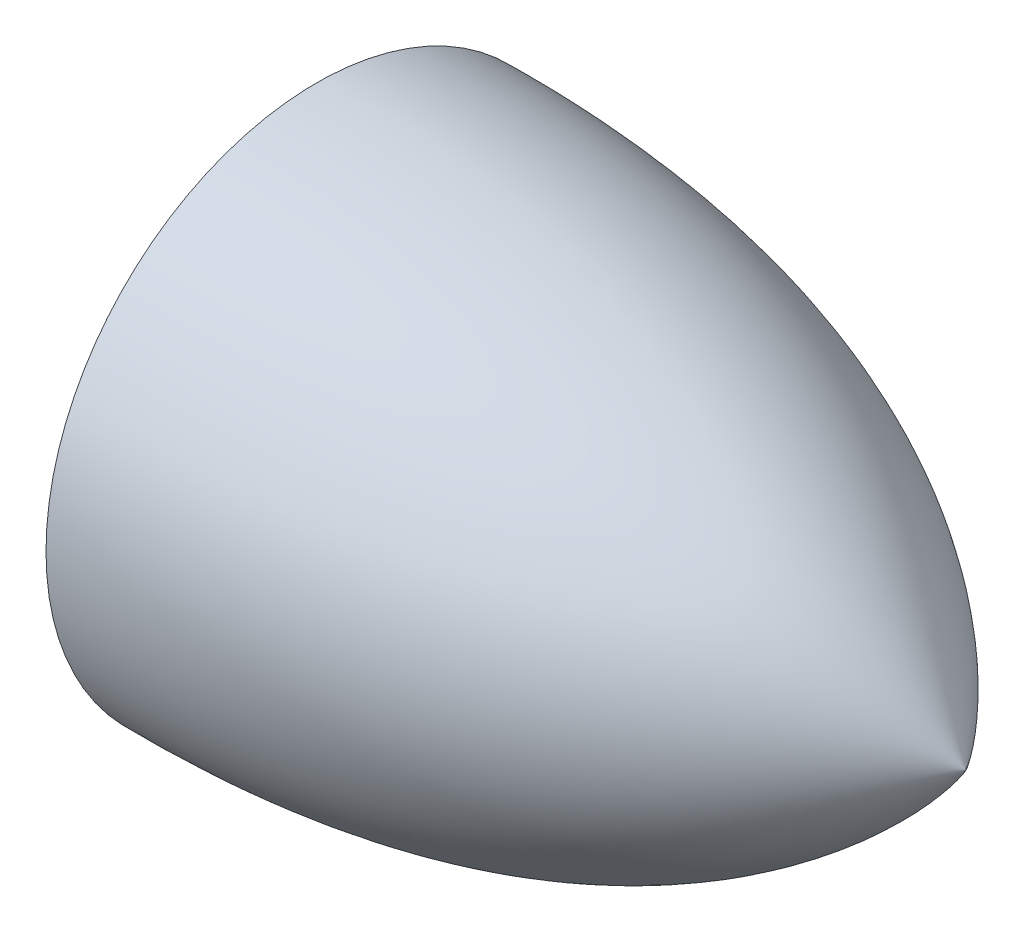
ISO-10303-21;
HEADER;
FILE_DESCRIPTION(('STEP AP214'),'2;1');
FILE_NAME('part.step','',(''),(''),'','','');
FILE_SCHEMA(('AUTOMOTIVE_DESIGN { 1 0 10303 214 1 1 1 1 }'));
ENDSEC;
DATA;
#1=APPLICATION_CONTEXT('core data for automotive mechanical design processes');
#2=APPLICATION_PROTOCOL_DEFINITION('international standard','automotive_design',2000,#1);
#3=PRODUCT_CONTEXT('',#1,'mechanical');
#4=PRODUCT('Part','Part','',(#3));
#5=PRODUCT_RELATED_PRODUCT_CATEGORY('part','',(#4));
#6=PRODUCT_DEFINITION_FORMATION('','',#4);
#7=PRODUCT_DEFINITION_CONTEXT('part definition',#1,'design');
#8=PRODUCT_DEFINITION('design','',#6,#7);
#9=PRODUCT_DEFINITION_SHAPE('','',#8);
#10=(LENGTH_UNIT() NAMED_UNIT(*) SI_UNIT(.MILLI.,.METRE.));
#11=(NAMED_UNIT(*) PLANE_ANGLE_UNIT() SI_UNIT($,.RADIAN.));
#12=(NAMED_UNIT(*) SI_UNIT($,.STERADIAN.) SOLID_ANGLE_UNIT());
#13=UNCERTAINTY_MEASURE_WITH_UNIT(LENGTH_MEASURE(1.E-05),#10,'distance_accuracy_value','');
#14=(GEOMETRIC_REPRESENTATION_CONTEXT(3) GLOBAL_UNCERTAINTY_ASSIGNED_CONTEXT((#13)) GLOBAL_UNIT_ASSIGNED_CONTEXT((#10,
#11,#12)) REPRESENTATION_CONTEXT('',''));
#15=CARTESIAN_POINT('',(0.,0.,0.));
#16=DIRECTION('',(0.,0.,1.));
#17=DIRECTION('',(1.,0.,0.));
#18=AXIS2_PLACEMENT_3D('',#15,#16,#17);
#19=CARTESIAN_POINT('',(6.,0.,0.));
#20=CARTESIAN_POINT('',(4.20094512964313,0.,-2.54796013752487));
#21=CARTESIAN_POINT('',(0.,0.,-2.5));
#22=B_SPLINE_CURVE_WITH_KNOTS('',2,(#19,#20,#21),.UNSPECIFIED.,.F.,.F.,(3,3),(0.,
0.789485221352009),.UNSPECIFIED.);
#23=CARTESIAN_POINT('',(-6.1095422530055,0.,0.));
#24=DIRECTION('',(-1.,0.,0.));
#25=AXIS1_PLACEMENT('',#23,#24);
#26=SURFACE_OF_REVOLUTION('',#22,#25);
#27=CARTESIAN_POINT('',(0.,0.,0.));
#28=DIRECTION('',(-1.,0.,0.));
#29=DIRECTION('',(0.,0.,1.));
#30=AXIS2_PLACEMENT_3D('',#27,#28,#29);
#31=CIRCLE('',#30,2.5);
#32=CARTESIAN_POINT('',(0.,0.,2.5));
#33=VERTEX_POINT('',#32);
#34=EDGE_CURVE('E11',#33,#33,#31,.T.);
#35=ORIENTED_EDGE('',*,*,#34,.F.);
#36=EDGE_LOOP('',(#35));
#37=FACE_BOUND('',#36,.T.);
#38=CARTESIAN_POINT('',(6.,0.,0.));
#39=VERTEX_POINT('',#38);
#40=VERTEX_LOOP('',#39);
#41=FACE_BOUND('',#40,.T.);
#42=ADVANCED_FACE('F32',(#37,#41),#26,.T.);
#43=CARTESIAN_POINT('',(0.,0.,-2.5));
#44=DIRECTION('',(1.,0.,0.));
#45=DIRECTION('',(0.,0.,-1.));
#46=AXIS2_PLACEMENT_3D('',#43,#44,#45);
#47=PLANE('',#46);
#48=CARTESIAN_POINT('',(0.,0.,0.));
#49=DIRECTION('',(-1.,0.,0.));
#50=DIRECTION('',(0.,0.,1.));
#51=AXIS2_PLACEMENT_3D('',#48,#49,#50);
#52=CIRCLE('',#51,0.75);
#53=CARTESIAN_POINT('',(0.,0.,0.75));
#54=VERTEX_POINT('',#53);
#55=EDGE_CURVE('E65',#54,#54,#52,.T.);
#56=ORIENTED_EDGE('',*,*,#55,.F.);
#57=EDGE_LOOP('',(#56));
#58=FACE_BOUND('',#57,.T.);
#59=ORIENTED_EDGE('',*,*,#34,.T.);
#60=EDGE_LOOP('',(#59));
#61=FACE_BOUND('',#60,.T.);
#62=ADVANCED_FACE('F42',(#58,#61),#47,.F.);
#63=CARTESIAN_POINT('',(3.,0.,0.));
#64=DIRECTION('',(-1.,0.,0.));
#65=DIRECTION('',(0.,0.,1.));
#66=AXIS2_PLACEMENT_3D('',#63,#64,#65);
#67=CYLINDRICAL_SURFACE('',#66,0.75);
#68=CARTESIAN_POINT('',(3.,0.,0.));
#69=DIRECTION('',(-1.,0.,0.));
#70=DIRECTION('',(0.,0.,1.));
#71=AXIS2_PLACEMENT_3D('',#68,#69,#70);
#72=CIRCLE('',#71,0.75);
#73=CARTESIAN_POINT('',(3.,0.,0.75));
#74=VERTEX_POINT('',#73);
#75=EDGE_CURVE('E38',#74,#74,#72,.T.);
#76=ORIENTED_EDGE('',*,*,#75,.F.);
#77=EDGE_LOOP('',(#76));
#78=FACE_BOUND('',#77,.T.);
#79=ORIENTED_EDGE('',*,*,#55,.T.);
#80=EDGE_LOOP('',(#79));
#81=FACE_BOUND('',#80,.T.);
#82=ADVANCED_FACE('F47',(#78,#81),#67,.F.);
#83=CARTESIAN_POINT('',(3.,0.,0.));
#84=DIRECTION('',(-1.,0.,0.));
#85=DIRECTION('',(0.,0.,1.));
#86=AXIS2_PLACEMENT_3D('',#83,#84,#85);
#87=PLANE('',#86);
#88=ORIENTED_EDGE('',*,*,#75,.T.);
#89=EDGE_LOOP('',(#88));
#90=FACE_BOUND('',#89,.T.);
#91=ADVANCED_FACE('F54',(#90),#87,.T.);
#92=CLOSED_SHELL('',(#42,#62,#82,#91));
#93=MANIFOLD_SOLID_BREP('B2',#92);
#94=ADVANCED_BREP_SHAPE_REPRESENTATION('',(#18,#93),#14);
#95=SHAPE_DEFINITION_REPRESENTATION(#9,#94);
ENDSEC;
END-ISO-10303-21;
